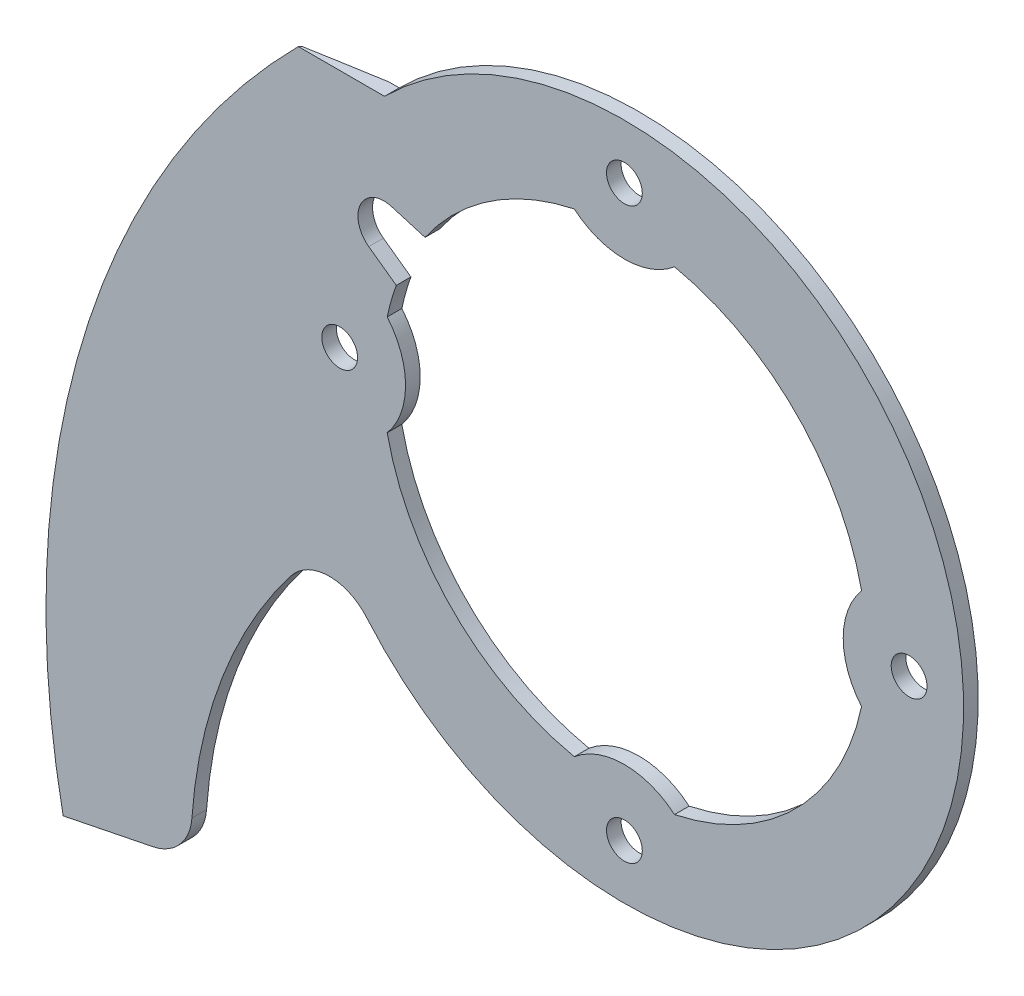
ISO-10303-21;
HEADER;
FILE_DESCRIPTION(('STEP AP214'),'2;1');
FILE_NAME('part.step','',(''),(''),'','','');
FILE_SCHEMA(('AUTOMOTIVE_DESIGN { 1 0 10303 214 1 1 1 1 }'));
ENDSEC;
DATA;
#1=APPLICATION_CONTEXT('core data for automotive mechanical design processes');
#2=APPLICATION_PROTOCOL_DEFINITION('international standard','automotive_design',2000,#1);
#3=PRODUCT_CONTEXT('',#1,'mechanical');
#4=PRODUCT('Part','Part','',(#3));
#5=PRODUCT_RELATED_PRODUCT_CATEGORY('part','',(#4));
#6=PRODUCT_DEFINITION_FORMATION('','',#4);
#7=PRODUCT_DEFINITION_CONTEXT('part definition',#1,'design');
#8=PRODUCT_DEFINITION('design','',#6,#7);
#9=PRODUCT_DEFINITION_SHAPE('','',#8);
#10=(LENGTH_UNIT() NAMED_UNIT(*) SI_UNIT(.MILLI.,.METRE.));
#11=(NAMED_UNIT(*) PLANE_ANGLE_UNIT() SI_UNIT($,.RADIAN.));
#12=(NAMED_UNIT(*) SI_UNIT($,.STERADIAN.) SOLID_ANGLE_UNIT());
#13=UNCERTAINTY_MEASURE_WITH_UNIT(LENGTH_MEASURE(1.E-05),#10,'distance_accuracy_value','');
#14=(GEOMETRIC_REPRESENTATION_CONTEXT(3) GLOBAL_UNCERTAINTY_ASSIGNED_CONTEXT((#13)) GLOBAL_UNIT_ASSIGNED_CONTEXT((#10,
#11,#12)) REPRESENTATION_CONTEXT('',''));
#15=CARTESIAN_POINT('',(0.,0.,0.));
#16=DIRECTION('',(0.,0.,1.));
#17=DIRECTION('',(1.,0.,0.));
#18=AXIS2_PLACEMENT_3D('',#15,#16,#17);
#19=CARTESIAN_POINT('',(0.,0.,0.));
#20=DIRECTION('',(0.,0.,1.));
#21=DIRECTION('',(1.,0.,0.));
#22=AXIS2_PLACEMENT_3D('',#19,#20,#21);
#23=PLANE('',#22);
#24=CARTESIAN_POINT('',(-1.83302876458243E-13,17.5,0.));
#25=DIRECTION('',(0.,0.,1.));
#26=DIRECTION('',(1.,0.,0.));
#27=AXIS2_PLACEMENT_3D('',#24,#25,#26);
#28=CIRCLE('',#27,1.1);
#29=CARTESIAN_POINT('',(1.09999999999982,17.5,0.));
#30=VERTEX_POINT('',#29);
#31=EDGE_CURVE('E182',#30,#30,#28,.T.);
#32=ORIENTED_EDGE('',*,*,#31,.T.);
#33=EDGE_LOOP('',(#32));
#34=FACE_BOUND('',#33,.T.);
#35=CARTESIAN_POINT('',(0.,0.,0.));
#36=DIRECTION('',(0.,0.,1.));
#37=DIRECTION('',(1.,0.,0.));
#38=AXIS2_PLACEMENT_3D('',#35,#36,#37);
#39=CIRCLE('',#38,14.9);
#40=CARTESIAN_POINT('',(3.08048237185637,-14.5780872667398,0.));
#41=VERTEX_POINT('',#40);
#42=CARTESIAN_POINT('',(14.5780872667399,-3.08048237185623,0.));
#43=VERTEX_POINT('',#42);
#44=EDGE_CURVE('E264',#41,#43,#39,.T.);
#45=ORIENTED_EDGE('',*,*,#44,.T.);
#46=CARTESIAN_POINT('',(18.22,1.27229653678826E-13,0.));
#47=DIRECTION('',(0.,0.,1.));
#48=DIRECTION('',(1.,0.,0.));
#49=AXIS2_PLACEMENT_3D('',#46,#47,#48);
#50=CIRCLE('',#49,4.77);
#51=CARTESIAN_POINT('',(14.5780872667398,3.08048237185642,0.));
#52=VERTEX_POINT('',#51);
#53=EDGE_CURVE('E262',#52,#43,#50,.T.);
#54=ORIENTED_EDGE('',*,*,#53,.F.);
#55=CARTESIAN_POINT('',(3.08048237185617,14.5780872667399,0.));
#56=VERTEX_POINT('',#55);
#57=EDGE_CURVE('E286',#52,#56,#39,.T.);
#58=ORIENTED_EDGE('',*,*,#57,.T.);
#59=CARTESIAN_POINT('',(-1.90844480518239E-13,18.22,0.));
#60=DIRECTION('',(0.,0.,1.));
#61=DIRECTION('',(1.,0.,0.));
#62=AXIS2_PLACEMENT_3D('',#59,#60,#61);
#63=CIRCLE('',#62,4.77);
#64=CARTESIAN_POINT('',(-3.08048237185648,14.5780872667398,0.));
#65=VERTEX_POINT('',#64);
#66=EDGE_CURVE('E283',#65,#56,#63,.T.);
#67=ORIENTED_EDGE('',*,*,#66,.F.);
#68=CARTESIAN_POINT('',(-12.2522810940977,8.4788919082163,0.));
#69=VERTEX_POINT('',#68);
#70=EDGE_CURVE('E282',#65,#69,#39,.T.);
#71=ORIENTED_EDGE('',*,*,#70,.T.);
#72=DIRECTION('',(-0.958968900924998,0.283511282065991,0.));
#73=VECTOR('',#72,1.);
#74=CARTESIAN_POINT('',(-12.2522810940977,8.4788919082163,0.));
#75=LINE('',#74,#73);
#76=CARTESIAN_POINT('',(-14.3261550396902,9.09201571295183,0.));
#77=VERTEX_POINT('',#76);
#78=EDGE_CURVE('E279',#69,#77,#75,.T.);
#79=ORIENTED_EDGE('',*,*,#78,.T.);
#80=CARTESIAN_POINT('',(-14.7797730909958,7.55766547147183,0.));
#81=DIRECTION('',(0.,0.,1.));
#82=DIRECTION('',(1.,0.,0.));
#83=AXIS2_PLACEMENT_3D('',#80,#81,#82);
#84=CIRCLE('',#83,1.6);
#85=CARTESIAN_POINT('',(-15.7137076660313,6.25852490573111,0.));
#86=VERTEX_POINT('',#85);
#87=EDGE_CURVE('E276',#77,#86,#84,.T.);
#88=ORIENTED_EDGE('',*,*,#87,.T.);
#89=DIRECTION('',(0.811962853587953,-0.583709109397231,0.));
#90=VECTOR('',#89,1.);
#91=CARTESIAN_POINT('',(-15.7137076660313,6.25852490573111,0.));
#92=LINE('',#91,#90);
#93=CARTESIAN_POINT('',(-14.0210912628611,5.04172587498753,0.));
#94=VERTEX_POINT('',#93);
#95=EDGE_CURVE('E273',#86,#94,#92,.T.);
#96=ORIENTED_EDGE('',*,*,#95,.T.);
#97=CARTESIAN_POINT('',(-14.5780872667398,3.08048237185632,0.));
#98=VERTEX_POINT('',#97);
#99=EDGE_CURVE('E272',#94,#98,#39,.T.);
#100=ORIENTED_EDGE('',*,*,#99,.T.);
#101=CARTESIAN_POINT('',(-18.22,0.,0.));
#102=DIRECTION('',(0.,0.,1.));
#103=DIRECTION('',(1.,0.,0.));
#104=AXIS2_PLACEMENT_3D('',#101,#102,#103);
#105=CIRCLE('',#104,4.77);
#106=CARTESIAN_POINT('',(-14.5780872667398,-3.08048237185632,0.));
#107=VERTEX_POINT('',#106);
#108=EDGE_CURVE('E269',#107,#98,#105,.T.);
#109=ORIENTED_EDGE('',*,*,#108,.F.);
#110=CARTESIAN_POINT('',(-3.08048237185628,-14.5780872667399,0.));
#111=VERTEX_POINT('',#110);
#112=EDGE_CURVE('E268',#107,#111,#39,.T.);
#113=ORIENTED_EDGE('',*,*,#112,.T.);
#114=CARTESIAN_POINT('',(0.,-18.22,0.));
#115=DIRECTION('',(0.,0.,1.));
#116=DIRECTION('',(1.,0.,0.));
#117=AXIS2_PLACEMENT_3D('',#114,#115,#116);
#118=CIRCLE('',#117,4.77);
#119=EDGE_CURVE('E265',#41,#111,#118,.T.);
#120=ORIENTED_EDGE('',*,*,#119,.F.);
#121=EDGE_LOOP('',(#45,#54,#58,#67,#71,#79,#88,#96,#100,#109,#113,#120));
#122=FACE_BOUND('',#121,.T.);
#123=CARTESIAN_POINT('',(0.,-17.5,0.));
#124=DIRECTION('',(0.,0.,1.));
#125=DIRECTION('',(1.,0.,0.));
#126=AXIS2_PLACEMENT_3D('',#123,#124,#125);
#127=CIRCLE('',#126,1.1);
#128=CARTESIAN_POINT('',(1.10000000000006,-17.5,0.));
#129=VERTEX_POINT('',#128);
#130=EDGE_CURVE('E348',#129,#129,#127,.T.);
#131=ORIENTED_EDGE('',*,*,#130,.T.);
#132=EDGE_LOOP('',(#131));
#133=FACE_BOUND('',#132,.T.);
#134=CARTESIAN_POINT('',(-17.5,0.,0.));
#135=DIRECTION('',(0.,0.,1.));
#136=DIRECTION('',(1.,0.,0.));
#137=AXIS2_PLACEMENT_3D('',#134,#135,#136);
#138=CIRCLE('',#137,1.1);
#139=CARTESIAN_POINT('',(-16.4,0.,0.));
#140=VERTEX_POINT('',#139);
#141=EDGE_CURVE('E199',#140,#140,#138,.T.);
#142=ORIENTED_EDGE('',*,*,#141,.T.);
#143=EDGE_LOOP('',(#142));
#144=FACE_BOUND('',#143,.T.);
#145=CARTESIAN_POINT('',(17.5,1.22201917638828E-13,0.));
#146=DIRECTION('',(0.,0.,1.));
#147=DIRECTION('',(1.,0.,0.));
#148=AXIS2_PLACEMENT_3D('',#145,#146,#147);
#149=CIRCLE('',#148,1.1);
#150=CARTESIAN_POINT('',(18.6,1.22201917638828E-13,0.));
#151=VERTEX_POINT('',#150);
#152=EDGE_CURVE('E342',#151,#151,#149,.T.);
#153=ORIENTED_EDGE('',*,*,#152,.T.);
#154=EDGE_LOOP('',(#153));
#155=FACE_BOUND('',#154,.T.);
#156=CARTESIAN_POINT('',(2.81403907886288,-31.6919290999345,0.));
#157=DIRECTION('',(0.,0.,-1.));
#158=DIRECTION('',(-1.,0.,0.));
#159=AXIS2_PLACEMENT_3D('',#156,#157,#158);
#160=CIRCLE('',#159,29.4703466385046);
#161=CARTESIAN_POINT('',(-26.5814833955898,-29.5932177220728,0.));
#162=VERTEX_POINT('',#161);
#163=CARTESIAN_POINT('',(-20.4997424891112,-13.6650347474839,0.));
#164=VERTEX_POINT('',#163);
#165=EDGE_CURVE('E196',#162,#164,#160,.T.);
#166=ORIENTED_EDGE('',*,*,#165,.F.);
#167=CARTESIAN_POINT('',(-29.5738665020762,-29.3795746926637,0.));
#168=DIRECTION('',(0.,0.,1.));
#169=DIRECTION('',(1.,0.,0.));
#170=AXIS2_PLACEMENT_3D('',#167,#168,#169);
#171=CIRCLE('',#170,3.);
#172=CARTESIAN_POINT('',(-28.9795506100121,-32.3201169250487,0.));
#173=VERTEX_POINT('',#172);
#174=EDGE_CURVE('E51',#162,#173,#171,.F.);
#175=ORIENTED_EDGE('',*,*,#174,.T.);
#176=DIRECTION('',(0.980180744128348,0.198105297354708,0.));
#177=VECTOR('',#176,1.);
#178=CARTESIAN_POINT('',(-34.4973270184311,-33.4353201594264,0.));
#179=LINE('',#178,#177);
#180=CARTESIAN_POINT('',(-31.3607486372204,-32.8013832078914,0.));
#181=VERTEX_POINT('',#180);
#182=EDGE_CURVE('E187',#181,#173,#179,.T.);
#183=ORIENTED_EDGE('',*,*,#182,.F.);
#184=CARTESIAN_POINT('',(17.7955101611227,-22.8663632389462,0.));
#185=DIRECTION('',(0.,0.,1.));
#186=DIRECTION('',(1.,0.,0.));
#187=AXIS2_PLACEMENT_3D('',#184,#185,#186);
#188=CIRCLE('',#187,50.1501984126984);
#189=CARTESIAN_POINT('',(-15.3792532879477,14.7431763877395,0.));
#190=VERTEX_POINT('',#189);
#191=EDGE_CURVE('E176',#190,#181,#188,.T.);
#192=ORIENTED_EDGE('',*,*,#191,.F.);
#193=DIRECTION('',(-1.,0.,0.));
#194=VECTOR('',#193,1.);
#195=CARTESIAN_POINT('',(-14.7431763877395,14.7431763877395,0.));
#196=LINE('',#195,#194);
#197=CARTESIAN_POINT('',(-14.7431763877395,14.7431763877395,0.));
#198=VERTEX_POINT('',#197);
#199=EDGE_CURVE('E186',#198,#190,#196,.T.);
#200=ORIENTED_EDGE('',*,*,#199,.F.);
#201=CARTESIAN_POINT('',(0.,0.,0.));
#202=DIRECTION('',(0.,0.,1.));
#203=DIRECTION('',(1.,0.,0.));
#204=AXIS2_PLACEMENT_3D('',#201,#202,#203);
#205=CIRCLE('',#204,20.85);
#206=CARTESIAN_POINT('',(-15.8464054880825,-13.5504218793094,0.));
#207=VERTEX_POINT('',#206);
#208=EDGE_CURVE('E204',#207,#198,#205,.T.);
#209=ORIENTED_EDGE('',*,*,#208,.F.);
#210=CARTESIAN_POINT('',(-18.1264638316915,-15.5001228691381,0.));
#211=DIRECTION('',(0.,0.,1.));
#212=DIRECTION('',(1.,0.,0.));
#213=AXIS2_PLACEMENT_3D('',#210,#211,#212);
#214=CIRCLE('',#213,3.);
#215=EDGE_CURVE('E407',#207,#164,#214,.T.);
#216=ORIENTED_EDGE('',*,*,#215,.T.);
#217=EDGE_LOOP('',(#166,#175,#183,#192,#200,#209,#216));
#218=FACE_BOUND('',#217,.T.);
#219=ADVANCED_FACE('F28',(#34,#122,#133,#144,#155,#218),#23,.F.);
#220=CARTESIAN_POINT('',(-14.7431763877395,14.7431763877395,0.9));
#221=DIRECTION('',(0.,-1.,0.));
#222=DIRECTION('',(1.,0.,0.));
#223=AXIS2_PLACEMENT_3D('',#220,#221,#222);
#224=PLANE('',#223);
#225=CARTESIAN_POINT('',(-28.745575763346,14.7431763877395,2.4218749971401));
#226=CARTESIAN_POINT('',(-27.9623567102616,14.7431763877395,2.26958447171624));
#227=CARTESIAN_POINT('',(-27.1788547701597,14.7431763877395,2.11874863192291));
#228=CARTESIAN_POINT('',(-25.6112343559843,14.7431763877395,1.82029784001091));
#229=CARTESIAN_POINT('',(-24.8271158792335,14.7431763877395,1.67268290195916));
#230=CARTESIAN_POINT('',(-22.4739706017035,14.7431763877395,1.23517603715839));
#231=CARTESIAN_POINT('',(-20.9039534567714,14.7431763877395,0.950582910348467));
#232=CARTESIAN_POINT('',(-17.7608209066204,14.7431763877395,0.398540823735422));
#233=CARTESIAN_POINT('',(-16.1877053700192,14.7431763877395,0.131092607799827));
#234=CARTESIAN_POINT('',(-13.8253794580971,14.7431763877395,-0.254423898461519));
#235=CARTESIAN_POINT('',(-13.0374459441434,14.7431763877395,-0.380327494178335));
#236=CARTESIAN_POINT('',(-11.4606698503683,14.7431763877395,-0.626361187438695));
#237=CARTESIAN_POINT('',(-10.6718272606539,14.7431763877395,-0.74649122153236));
#238=CARTESIAN_POINT('',(-9.88251001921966,14.7431763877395,-0.863458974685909));
#239=B_SPLINE_CURVE_WITH_KNOTS('',3,(#225,#226,#227,#228,#229,#230,#231,#232,#233,#234,#235,
#236,#237,#238),.UNSPECIFIED.,.F.,.F.,(4,2,2,2,2,2,4),(0.,2.39366052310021,4.78733149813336,
9.57406061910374,14.3609972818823,16.7547655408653,19.1485601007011),.UNSPECIFIED.);
#240=CARTESIAN_POINT('',(-19.944627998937,14.7431763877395,0.782537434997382));
#241=VERTEX_POINT('',#240);
#242=EDGE_CURVE('E172',#241,#190,#239,.T.);
#243=ORIENTED_EDGE('',*,*,#242,.F.);
#244=CARTESIAN_POINT('',(-19.944627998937,14.7431763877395,0.782537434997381));
#245=CARTESIAN_POINT('',(-19.9610589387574,14.7431763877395,0.801935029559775));
#246=CARTESIAN_POINT('',(-19.9774867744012,14.7431763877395,0.821335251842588));
#247=CARTESIAN_POINT('',(-20.0103362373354,14.7431763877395,0.860140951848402));
#248=CARTESIAN_POINT('',(-20.0267578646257,14.7431763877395,0.879546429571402));
#249=CARTESIAN_POINT('',(-20.0431763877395,14.7431763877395,0.898954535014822));
#250=B_SPLINE_CURVE_WITH_KNOTS('',3,(#244,#245,#246,#247,#248,#249),.UNSPECIFIED.,.F.,.F.,(4,2,
4),(0.,0.0762638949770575,0.152527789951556),.UNSPECIFIED.);
#251=CARTESIAN_POINT('',(-20.0431763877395,14.7431763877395,0.898954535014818));
#252=VERTEX_POINT('',#251);
#253=EDGE_CURVE('E231',#241,#252,#250,.T.);
#254=ORIENTED_EDGE('',*,*,#253,.T.);
#255=DIRECTION('',(0.,0.,-1.));
#256=VECTOR('',#255,1.);
#257=CARTESIAN_POINT('',(-20.0431763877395,14.7431763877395,0.9));
#258=LINE('',#257,#256);
#259=CARTESIAN_POINT('',(-20.0431763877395,14.7431763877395,0.9));
#260=VERTEX_POINT('',#259);
#261=EDGE_CURVE('E221',#260,#252,#258,.T.);
#262=ORIENTED_EDGE('',*,*,#261,.F.);
#263=DIRECTION('',(-1.,0.,0.));
#264=VECTOR('',#263,1.);
#265=CARTESIAN_POINT('',(-14.7431763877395,14.7431763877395,0.9));
#266=LINE('',#265,#264);
#267=CARTESIAN_POINT('',(-14.7431763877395,14.7431763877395,0.9));
#268=VERTEX_POINT('',#267);
#269=EDGE_CURVE('E207',#268,#260,#266,.T.);
#270=ORIENTED_EDGE('',*,*,#269,.F.);
#271=DIRECTION('',(0.,0.,-1.));
#272=VECTOR('',#271,1.);
#273=CARTESIAN_POINT('',(-14.7431763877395,14.7431763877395,0.9));
#274=LINE('',#273,#272);
#275=EDGE_CURVE('E193',#268,#198,#274,.T.);
#276=ORIENTED_EDGE('',*,*,#275,.T.);
#277=ORIENTED_EDGE('',*,*,#199,.T.);
#278=EDGE_LOOP('',(#243,#254,#262,#270,#276,#277));
#279=FACE_BOUND('',#278,.T.);
#280=ADVANCED_FACE('F30',(#279),#224,.F.);
#281=CARTESIAN_POINT('',(17.7955101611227,-22.8663632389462,0.9));
#282=DIRECTION('',(0.,0.,-1.));
#283=DIRECTION('',(-1.,0.,0.));
#284=AXIS2_PLACEMENT_3D('',#281,#282,#283);
#285=CYLINDRICAL_SURFACE('',#284,53.3501984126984);
#286=ORIENTED_EDGE('',*,*,#261,.T.);
#287=CARTESIAN_POINT('',(17.7955101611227,-22.8663632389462,0.898954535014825));
#288=DIRECTION('',(0.,0.,-1.));
#289=DIRECTION('',(-1.,0.,0.));
#290=AXIS2_PLACEMENT_3D('',#287,#288,#289);
#291=CIRCLE('',#290,53.3501984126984);
#292=CARTESIAN_POINT('',(-34.4973270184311,-33.4353201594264,0.898954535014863));
#293=VERTEX_POINT('',#292);
#294=EDGE_CURVE('E225',#252,#293,#291,.F.);
#295=ORIENTED_EDGE('',*,*,#294,.T.);
#296=DIRECTION('',(0.,0.,-1.));
#297=VECTOR('',#296,1.);
#298=CARTESIAN_POINT('',(-34.4973270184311,-33.4353201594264,0.9));
#299=LINE('',#298,#297);
#300=CARTESIAN_POINT('',(-34.4973270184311,-33.4353201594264,0.9));
#301=VERTEX_POINT('',#300);
#302=EDGE_CURVE('E217',#301,#293,#299,.T.);
#303=ORIENTED_EDGE('',*,*,#302,.F.);
#304=CARTESIAN_POINT('',(17.7955101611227,-22.8663632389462,0.9));
#305=DIRECTION('',(0.,0.,1.));
#306=DIRECTION('',(1.,0.,0.));
#307=AXIS2_PLACEMENT_3D('',#304,#305,#306);
#308=CIRCLE('',#307,53.3501984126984);
#309=EDGE_CURVE('E210',#260,#301,#308,.T.);
#310=ORIENTED_EDGE('',*,*,#309,.F.);
#311=EDGE_LOOP('',(#286,#295,#303,#310));
#312=FACE_BOUND('',#311,.T.);
#313=ADVANCED_FACE('F380',(#312),#285,.T.);
#314=CARTESIAN_POINT('',(-34.4973270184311,-33.4353201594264,0.9));
#315=DIRECTION('',(-0.198105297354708,0.980180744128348,0.));
#316=DIRECTION('',(-0.980180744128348,-0.198105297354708,0.));
#317=AXIS2_PLACEMENT_3D('',#314,#315,#316);
#318=PLANE('',#317);
#319=ORIENTED_EDGE('',*,*,#182,.T.);
#320=DIRECTION('',(0.,0.,-1.));
#321=VECTOR('',#320,1.);
#322=CARTESIAN_POINT('',(-28.9795506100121,-32.3201169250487,0.9));
#323=LINE('',#322,#321);
#324=CARTESIAN_POINT('',(-28.9795506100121,-32.3201169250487,0.9));
#325=VERTEX_POINT('',#324);
#326=EDGE_CURVE('E37',#173,#325,#323,.F.);
#327=ORIENTED_EDGE('',*,*,#326,.T.);
#328=DIRECTION('',(0.980180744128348,0.198105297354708,0.));
#329=VECTOR('',#328,1.);
#330=CARTESIAN_POINT('',(-34.4973270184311,-33.4353201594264,0.9));
#331=LINE('',#330,#329);
#332=EDGE_CURVE('E213',#301,#325,#331,.T.);
#333=ORIENTED_EDGE('',*,*,#332,.F.);
#334=ORIENTED_EDGE('',*,*,#302,.T.);
#335=DIRECTION('',(-0.504298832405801,-0.1019243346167,0.857492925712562));
#336=VECTOR('',#335,1.);
#337=CARTESIAN_POINT('',(17.7955101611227,-22.8663632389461,-88.0180428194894));
#338=LINE('',#337,#336);
#339=CARTESIAN_POINT('',(-34.4288611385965,-33.4214824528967,0.782537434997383));
#340=VERTEX_POINT('',#339);
#341=EDGE_CURVE('E228',#293,#340,#338,.F.);
#342=ORIENTED_EDGE('',*,*,#341,.T.);
#343=DIRECTION('',(0.950914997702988,0.192190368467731,-0.242535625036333));
#344=VECTOR('',#343,1.);
#345=CARTESIAN_POINT('',(-34.4973270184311,-33.4353201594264,0.8));
#346=LINE('',#345,#344);
#347=EDGE_CURVE('E188',#340,#181,#346,.T.);
#348=ORIENTED_EDGE('',*,*,#347,.T.);
#349=EDGE_LOOP('',(#319,#327,#333,#334,#342,#348));
#350=FACE_BOUND('',#349,.T.);
#351=ADVANCED_FACE('F385',(#350),#318,.F.);
#352=CARTESIAN_POINT('',(0.,0.,0.9));
#353=DIRECTION('',(0.,0.,1.));
#354=DIRECTION('',(1.,0.,0.));
#355=AXIS2_PLACEMENT_3D('',#352,#353,#354);
#356=PLANE('',#355);
#357=CARTESIAN_POINT('',(17.5,1.22201917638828E-13,0.9));
#358=DIRECTION('',(0.,0.,1.));
#359=DIRECTION('',(1.,0.,0.));
#360=AXIS2_PLACEMENT_3D('',#357,#358,#359);
#361=CIRCLE('',#360,1.1);
#362=CARTESIAN_POINT('',(18.6,1.22201917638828E-13,0.9));
#363=VERTEX_POINT('',#362);
#364=EDGE_CURVE('E345',#363,#363,#361,.T.);
#365=ORIENTED_EDGE('',*,*,#364,.F.);
#366=EDGE_LOOP('',(#365));
#367=FACE_BOUND('',#366,.T.);
#368=CARTESIAN_POINT('',(-17.5,0.,0.9));
#369=DIRECTION('',(0.,0.,1.));
#370=DIRECTION('',(1.,0.,0.));
#371=AXIS2_PLACEMENT_3D('',#368,#369,#370);
#372=CIRCLE('',#371,1.1);
#373=CARTESIAN_POINT('',(-16.4,0.,0.9));
#374=VERTEX_POINT('',#373);
#375=EDGE_CURVE('E194',#374,#374,#372,.T.);
#376=ORIENTED_EDGE('',*,*,#375,.F.);
#377=EDGE_LOOP('',(#376));
#378=FACE_BOUND('',#377,.T.);
#379=ORIENTED_EDGE('',*,*,#332,.T.);
#380=CARTESIAN_POINT('',(-29.5738665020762,-29.3795746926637,0.9));
#381=DIRECTION('',(0.,0.,1.));
#382=DIRECTION('',(1.,0.,0.));
#383=AXIS2_PLACEMENT_3D('',#380,#381,#382);
#384=CIRCLE('',#383,3.);
#385=CARTESIAN_POINT('',(-26.5814833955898,-29.5932177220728,0.9));
#386=VERTEX_POINT('',#385);
#387=EDGE_CURVE('E11',#325,#386,#384,.T.);
#388=ORIENTED_EDGE('',*,*,#387,.T.);
#389=CARTESIAN_POINT('',(2.81403907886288,-31.6919290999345,0.9));
#390=DIRECTION('',(0.,0.,-1.));
#391=DIRECTION('',(-1.,0.,0.));
#392=AXIS2_PLACEMENT_3D('',#389,#390,#391);
#393=CIRCLE('',#392,29.4703466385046);
#394=CARTESIAN_POINT('',(-20.4997424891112,-13.6650347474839,0.9));
#395=VERTEX_POINT('',#394);
#396=EDGE_CURVE('E215',#386,#395,#393,.T.);
#397=ORIENTED_EDGE('',*,*,#396,.T.);
#398=CARTESIAN_POINT('',(-18.1264638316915,-15.5001228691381,0.9));
#399=DIRECTION('',(0.,0.,1.));
#400=DIRECTION('',(1.,0.,0.));
#401=AXIS2_PLACEMENT_3D('',#398,#399,#400);
#402=CIRCLE('',#401,3.);
#403=CARTESIAN_POINT('',(-15.8464054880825,-13.5504218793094,0.9));
#404=VERTEX_POINT('',#403);
#405=EDGE_CURVE('E403',#395,#404,#402,.F.);
#406=ORIENTED_EDGE('',*,*,#405,.T.);
#407=CARTESIAN_POINT('',(0.,0.,0.9));
#408=DIRECTION('',(0.,0.,1.));
#409=DIRECTION('',(1.,0.,0.));
#410=AXIS2_PLACEMENT_3D('',#407,#408,#409);
#411=CIRCLE('',#410,20.85);
#412=EDGE_CURVE('E206',#404,#268,#411,.T.);
#413=ORIENTED_EDGE('',*,*,#412,.T.);
#414=ORIENTED_EDGE('',*,*,#269,.T.);
#415=ORIENTED_EDGE('',*,*,#309,.T.);
#416=EDGE_LOOP('',(#379,#388,#397,#406,#413,#414,#415));
#417=FACE_BOUND('',#416,.T.);
#418=CARTESIAN_POINT('',(0.,-17.5,0.9));
#419=DIRECTION('',(0.,0.,1.));
#420=DIRECTION('',(1.,0.,0.));
#421=AXIS2_PLACEMENT_3D('',#418,#419,#420);
#422=CIRCLE('',#421,1.1);
#423=CARTESIAN_POINT('',(1.10000000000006,-17.5,0.9));
#424=VERTEX_POINT('',#423);
#425=EDGE_CURVE('E351',#424,#424,#422,.T.);
#426=ORIENTED_EDGE('',*,*,#425,.F.);
#427=EDGE_LOOP('',(#426));
#428=FACE_BOUND('',#427,.T.);
#429=CARTESIAN_POINT('',(18.22,1.27229653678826E-13,0.9));
#430=DIRECTION('',(0.,0.,1.));
#431=DIRECTION('',(1.,0.,0.));
#432=AXIS2_PLACEMENT_3D('',#429,#430,#431);
#433=CIRCLE('',#432,4.77);
#434=CARTESIAN_POINT('',(14.5780872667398,3.08048237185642,0.9));
#435=VERTEX_POINT('',#434);
#436=CARTESIAN_POINT('',(14.5780872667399,-3.08048237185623,0.9));
#437=VERTEX_POINT('',#436);
#438=EDGE_CURVE('E289',#435,#437,#433,.T.);
#439=ORIENTED_EDGE('',*,*,#438,.T.);
#440=CARTESIAN_POINT('',(0.,0.,0.9));
#441=DIRECTION('',(0.,0.,1.));
#442=DIRECTION('',(1.,0.,0.));
#443=AXIS2_PLACEMENT_3D('',#440,#441,#442);
#444=CIRCLE('',#443,14.9);
#445=CARTESIAN_POINT('',(3.08048237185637,-14.5780872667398,0.9));
#446=VERTEX_POINT('',#445);
#447=EDGE_CURVE('E292',#446,#437,#444,.T.);
#448=ORIENTED_EDGE('',*,*,#447,.F.);
#449=CARTESIAN_POINT('',(0.,-18.22,0.9));
#450=DIRECTION('',(0.,0.,1.));
#451=DIRECTION('',(1.,0.,0.));
#452=AXIS2_PLACEMENT_3D('',#449,#450,#451);
#453=CIRCLE('',#452,4.77);
#454=CARTESIAN_POINT('',(-3.08048237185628,-14.5780872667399,0.9));
#455=VERTEX_POINT('',#454);
#456=EDGE_CURVE('E293',#446,#455,#453,.T.);
#457=ORIENTED_EDGE('',*,*,#456,.T.);
#458=CARTESIAN_POINT('',(-14.5780872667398,-3.08048237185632,0.9));
#459=VERTEX_POINT('',#458);
#460=EDGE_CURVE('E296',#459,#455,#444,.T.);
#461=ORIENTED_EDGE('',*,*,#460,.F.);
#462=CARTESIAN_POINT('',(-18.22,0.,0.9));
#463=DIRECTION('',(0.,0.,1.));
#464=DIRECTION('',(1.,0.,0.));
#465=AXIS2_PLACEMENT_3D('',#462,#463,#464);
#466=CIRCLE('',#465,4.77);
#467=CARTESIAN_POINT('',(-14.5780872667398,3.08048237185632,0.9));
#468=VERTEX_POINT('',#467);
#469=EDGE_CURVE('E297',#459,#468,#466,.T.);
#470=ORIENTED_EDGE('',*,*,#469,.T.);
#471=CARTESIAN_POINT('',(-14.0210912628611,5.04172587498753,0.9));
#472=VERTEX_POINT('',#471);
#473=EDGE_CURVE('E300',#472,#468,#444,.T.);
#474=ORIENTED_EDGE('',*,*,#473,.F.);
#475=DIRECTION('',(0.811962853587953,-0.583709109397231,0.));
#476=VECTOR('',#475,1.);
#477=CARTESIAN_POINT('',(-15.7137076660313,6.25852490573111,0.9));
#478=LINE('',#477,#476);
#479=CARTESIAN_POINT('',(-15.7137076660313,6.25852490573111,0.9));
#480=VERTEX_POINT('',#479);
#481=EDGE_CURVE('E301',#480,#472,#478,.T.);
#482=ORIENTED_EDGE('',*,*,#481,.F.);
#483=CARTESIAN_POINT('',(-14.7797730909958,7.55766547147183,0.9));
#484=DIRECTION('',(0.,0.,1.));
#485=DIRECTION('',(1.,0.,0.));
#486=AXIS2_PLACEMENT_3D('',#483,#484,#485);
#487=CIRCLE('',#486,1.6);
#488=CARTESIAN_POINT('',(-14.3261550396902,9.09201571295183,0.9));
#489=VERTEX_POINT('',#488);
#490=EDGE_CURVE('E304',#489,#480,#487,.T.);
#491=ORIENTED_EDGE('',*,*,#490,.F.);
#492=DIRECTION('',(-0.958968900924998,0.283511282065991,0.));
#493=VECTOR('',#492,1.);
#494=CARTESIAN_POINT('',(-12.2522810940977,8.4788919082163,0.9));
#495=LINE('',#494,#493);
#496=CARTESIAN_POINT('',(-12.2522810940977,8.4788919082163,0.9));
#497=VERTEX_POINT('',#496);
#498=EDGE_CURVE('E307',#497,#489,#495,.T.);
#499=ORIENTED_EDGE('',*,*,#498,.F.);
#500=CARTESIAN_POINT('',(-3.08048237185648,14.5780872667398,0.9));
#501=VERTEX_POINT('',#500);
#502=EDGE_CURVE('E310',#501,#497,#444,.T.);
#503=ORIENTED_EDGE('',*,*,#502,.F.);
#504=CARTESIAN_POINT('',(-1.90844480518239E-13,18.22,0.9));
#505=DIRECTION('',(0.,0.,1.));
#506=DIRECTION('',(1.,0.,0.));
#507=AXIS2_PLACEMENT_3D('',#504,#505,#506);
#508=CIRCLE('',#507,4.77);
#509=CARTESIAN_POINT('',(3.08048237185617,14.5780872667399,0.9));
#510=VERTEX_POINT('',#509);
#511=EDGE_CURVE('E311',#501,#510,#508,.T.);
#512=ORIENTED_EDGE('',*,*,#511,.T.);
#513=EDGE_CURVE('E314',#435,#510,#444,.T.);
#514=ORIENTED_EDGE('',*,*,#513,.F.);
#515=EDGE_LOOP('',(#439,#448,#457,#461,#470,#474,#482,#491,#499,#503,#512,#514));
#516=FACE_BOUND('',#515,.T.);
#517=CARTESIAN_POINT('',(-1.83302876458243E-13,17.5,0.9));
#518=DIRECTION('',(0.,0.,1.));
#519=DIRECTION('',(1.,0.,0.));
#520=AXIS2_PLACEMENT_3D('',#517,#518,#519);
#521=CIRCLE('',#520,1.1);
#522=CARTESIAN_POINT('',(1.09999999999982,17.5,0.9));
#523=VERTEX_POINT('',#522);
#524=EDGE_CURVE('E259',#523,#523,#521,.T.);
#525=ORIENTED_EDGE('',*,*,#524,.F.);
#526=EDGE_LOOP('',(#525));
#527=FACE_BOUND('',#526,.T.);
#528=ADVANCED_FACE('F383',(#367,#378,#417,#428,#516,#527),#356,.T.);
#529=CARTESIAN_POINT('',(2.81403907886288,-31.6919290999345,0.9));
#530=DIRECTION('',(0.,0.,-1.));
#531=DIRECTION('',(-1.,0.,0.));
#532=AXIS2_PLACEMENT_3D('',#529,#530,#531);
#533=CYLINDRICAL_SURFACE('',#532,29.4703466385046);
#534=ORIENTED_EDGE('',*,*,#396,.F.);
#535=DIRECTION('',(0.,0.,-1.));
#536=VECTOR('',#535,1.);
#537=CARTESIAN_POINT('',(-26.5814833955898,-29.5932177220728,0.9));
#538=LINE('',#537,#536);
#539=EDGE_CURVE('E416',#386,#162,#538,.T.);
#540=ORIENTED_EDGE('',*,*,#539,.T.);
#541=ORIENTED_EDGE('',*,*,#165,.T.);
#542=DIRECTION('',(0.,0.,-1.));
#543=VECTOR('',#542,1.);
#544=CARTESIAN_POINT('',(-20.4997424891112,-13.6650347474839,0.9));
#545=LINE('',#544,#543);
#546=EDGE_CURVE('E410',#164,#395,#545,.F.);
#547=ORIENTED_EDGE('',*,*,#546,.T.);
#548=EDGE_LOOP('',(#534,#540,#541,#547));
#549=FACE_BOUND('',#548,.T.);
#550=ADVANCED_FACE('F371',(#549),#533,.F.);
#551=CARTESIAN_POINT('',(0.,0.,0.9));
#552=DIRECTION('',(0.,0.,-1.));
#553=DIRECTION('',(-1.,0.,0.));
#554=AXIS2_PLACEMENT_3D('',#551,#552,#553);
#555=CYLINDRICAL_SURFACE('',#554,20.85);
#556=ORIENTED_EDGE('',*,*,#412,.F.);
#557=DIRECTION('',(0.,0.,-1.));
#558=VECTOR('',#557,1.);
#559=CARTESIAN_POINT('',(-15.8464054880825,-13.5504218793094,0.9));
#560=LINE('',#559,#558);
#561=EDGE_CURVE('E237',#404,#207,#560,.T.);
#562=ORIENTED_EDGE('',*,*,#561,.T.);
#563=ORIENTED_EDGE('',*,*,#208,.T.);
#564=ORIENTED_EDGE('',*,*,#275,.F.);
#565=EDGE_LOOP('',(#556,#562,#563,#564));
#566=FACE_BOUND('',#565,.T.);
#567=ADVANCED_FACE('F361',(#566),#555,.T.);
#568=CARTESIAN_POINT('',(-17.5,0.,0.9));
#569=DIRECTION('',(0.,0.,-1.));
#570=DIRECTION('',(-1.,0.,0.));
#571=AXIS2_PLACEMENT_3D('',#568,#569,#570);
#572=CYLINDRICAL_SURFACE('',#571,1.1);
#573=ORIENTED_EDGE('',*,*,#375,.T.);
#574=EDGE_LOOP('',(#573));
#575=FACE_BOUND('',#574,.T.);
#576=ORIENTED_EDGE('',*,*,#141,.F.);
#577=EDGE_LOOP('',(#576));
#578=FACE_BOUND('',#577,.T.);
#579=ADVANCED_FACE('F358',(#575,#578),#572,.F.);
#580=CARTESIAN_POINT('',(0.,-17.5,0.9));
#581=DIRECTION('',(0.,0.,-1.));
#582=DIRECTION('',(-1.,0.,0.));
#583=AXIS2_PLACEMENT_3D('',#580,#581,#582);
#584=CYLINDRICAL_SURFACE('',#583,1.1);
#585=ORIENTED_EDGE('',*,*,#425,.T.);
#586=EDGE_LOOP('',(#585));
#587=FACE_BOUND('',#586,.T.);
#588=ORIENTED_EDGE('',*,*,#130,.F.);
#589=EDGE_LOOP('',(#588));
#590=FACE_BOUND('',#589,.T.);
#591=ADVANCED_FACE('F360',(#587,#590),#584,.F.);
#592=CARTESIAN_POINT('',(17.5,1.22201917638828E-13,0.9));
#593=DIRECTION('',(0.,0.,-1.));
#594=DIRECTION('',(-1.,0.,0.));
#595=AXIS2_PLACEMENT_3D('',#592,#593,#594);
#596=CYLINDRICAL_SURFACE('',#595,1.1);
#597=ORIENTED_EDGE('',*,*,#364,.T.);
#598=EDGE_LOOP('',(#597));
#599=FACE_BOUND('',#598,.T.);
#600=ORIENTED_EDGE('',*,*,#152,.F.);
#601=EDGE_LOOP('',(#600));
#602=FACE_BOUND('',#601,.T.);
#603=ADVANCED_FACE('F368',(#599,#602),#596,.F.);
#604=CARTESIAN_POINT('',(18.22,1.27229653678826E-13,0.9));
#605=DIRECTION('',(0.,0.,-1.));
#606=DIRECTION('',(-1.,0.,0.));
#607=AXIS2_PLACEMENT_3D('',#604,#605,#606);
#608=CYLINDRICAL_SURFACE('',#607,4.77);
#609=DIRECTION('',(0.,0.,-1.));
#610=VECTOR('',#609,1.);
#611=CARTESIAN_POINT('',(14.5780872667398,3.08048237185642,0.9));
#612=LINE('',#611,#610);
#613=EDGE_CURVE('E340',#435,#52,#612,.T.);
#614=ORIENTED_EDGE('',*,*,#613,.T.);
#615=ORIENTED_EDGE('',*,*,#53,.T.);
#616=DIRECTION('',(0.,0.,-1.));
#617=VECTOR('',#616,1.);
#618=CARTESIAN_POINT('',(14.5780872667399,-3.08048237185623,0.9));
#619=LINE('',#618,#617);
#620=EDGE_CURVE('E317',#437,#43,#619,.T.);
#621=ORIENTED_EDGE('',*,*,#620,.F.);
#622=ORIENTED_EDGE('',*,*,#438,.F.);
#623=EDGE_LOOP('',(#614,#615,#621,#622));
#624=FACE_BOUND('',#623,.T.);
#625=ADVANCED_FACE('F526',(#624),#608,.T.);
#626=CARTESIAN_POINT('',(0.,0.,0.9));
#627=DIRECTION('',(0.,0.,-1.));
#628=DIRECTION('',(-1.,0.,0.));
#629=AXIS2_PLACEMENT_3D('',#626,#627,#628);
#630=CYLINDRICAL_SURFACE('',#629,14.9);
#631=DIRECTION('',(0.,0.,-1.));
#632=VECTOR('',#631,1.);
#633=CARTESIAN_POINT('',(3.08048237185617,14.5780872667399,0.9));
#634=LINE('',#633,#632);
#635=EDGE_CURVE('E338',#510,#56,#634,.T.);
#636=ORIENTED_EDGE('',*,*,#635,.T.);
#637=ORIENTED_EDGE('',*,*,#57,.F.);
#638=ORIENTED_EDGE('',*,*,#613,.F.);
#639=ORIENTED_EDGE('',*,*,#513,.T.);
#640=EDGE_LOOP('',(#636,#637,#638,#639));
#641=FACE_BOUND('',#640,.T.);
#642=ADVANCED_FACE('F452',(#641),#630,.F.);
#643=CARTESIAN_POINT('',(-1.90844480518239E-13,18.22,0.9));
#644=DIRECTION('',(0.,0.,-1.));
#645=DIRECTION('',(-1.,0.,0.));
#646=AXIS2_PLACEMENT_3D('',#643,#644,#645);
#647=CYLINDRICAL_SURFACE('',#646,4.77);
#648=DIRECTION('',(0.,0.,-1.));
#649=VECTOR('',#648,1.);
#650=CARTESIAN_POINT('',(-3.08048237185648,14.5780872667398,0.9));
#651=LINE('',#650,#649);
#652=EDGE_CURVE('E336',#501,#65,#651,.T.);
#653=ORIENTED_EDGE('',*,*,#652,.T.);
#654=ORIENTED_EDGE('',*,*,#66,.T.);
#655=ORIENTED_EDGE('',*,*,#635,.F.);
#656=ORIENTED_EDGE('',*,*,#511,.F.);
#657=EDGE_LOOP('',(#653,#654,#655,#656));
#658=FACE_BOUND('',#657,.T.);
#659=ADVANCED_FACE('F512',(#658),#647,.T.);
#660=DIRECTION('',(0.,0.,-1.));
#661=VECTOR('',#660,1.);
#662=CARTESIAN_POINT('',(-12.2522810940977,8.4788919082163,0.9));
#663=LINE('',#662,#661);
#664=EDGE_CURVE('E334',#497,#69,#663,.T.);
#665=ORIENTED_EDGE('',*,*,#664,.T.);
#666=ORIENTED_EDGE('',*,*,#70,.F.);
#667=ORIENTED_EDGE('',*,*,#652,.F.);
#668=ORIENTED_EDGE('',*,*,#502,.T.);
#669=EDGE_LOOP('',(#665,#666,#667,#668));
#670=FACE_BOUND('',#669,.T.);
#671=ADVANCED_FACE('F483',(#670),#630,.F.);
#672=CARTESIAN_POINT('',(-12.2522810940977,8.4788919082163,0.9));
#673=DIRECTION('',(-0.283511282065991,-0.958968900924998,0.));
#674=DIRECTION('',(0.958968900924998,-0.283511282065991,0.));
#675=AXIS2_PLACEMENT_3D('',#672,#673,#674);
#676=PLANE('',#675);
#677=DIRECTION('',(0.,0.,-1.));
#678=VECTOR('',#677,1.);
#679=CARTESIAN_POINT('',(-14.3261550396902,9.09201571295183,0.9));
#680=LINE('',#679,#678);
#681=EDGE_CURVE('E332',#489,#77,#680,.T.);
#682=ORIENTED_EDGE('',*,*,#681,.T.);
#683=ORIENTED_EDGE('',*,*,#78,.F.);
#684=ORIENTED_EDGE('',*,*,#664,.F.);
#685=ORIENTED_EDGE('',*,*,#498,.T.);
#686=EDGE_LOOP('',(#682,#683,#684,#685));
#687=FACE_BOUND('',#686,.T.);
#688=ADVANCED_FACE('F497',(#687),#676,.T.);
#689=CARTESIAN_POINT('',(-14.7797730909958,7.55766547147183,0.9));
#690=DIRECTION('',(0.,0.,-1.));
#691=DIRECTION('',(-1.,0.,0.));
#692=AXIS2_PLACEMENT_3D('',#689,#690,#691);
#693=CYLINDRICAL_SURFACE('',#692,1.6);
#694=DIRECTION('',(0.,0.,-1.));
#695=VECTOR('',#694,1.);
#696=CARTESIAN_POINT('',(-15.7137076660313,6.25852490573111,0.9));
#697=LINE('',#696,#695);
#698=EDGE_CURVE('E330',#480,#86,#697,.T.);
#699=ORIENTED_EDGE('',*,*,#698,.T.);
#700=ORIENTED_EDGE('',*,*,#87,.F.);
#701=ORIENTED_EDGE('',*,*,#681,.F.);
#702=ORIENTED_EDGE('',*,*,#490,.T.);
#703=EDGE_LOOP('',(#699,#700,#701,#702));
#704=FACE_BOUND('',#703,.T.);
#705=ADVANCED_FACE('F489',(#704),#693,.F.);
#706=CARTESIAN_POINT('',(-15.7137076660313,6.25852490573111,0.9));
#707=DIRECTION('',(0.583709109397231,0.811962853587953,0.));
#708=DIRECTION('',(-0.811962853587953,0.583709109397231,0.));
#709=AXIS2_PLACEMENT_3D('',#706,#707,#708);
#710=PLANE('',#709);
#711=DIRECTION('',(0.,0.,-1.));
#712=VECTOR('',#711,1.);
#713=CARTESIAN_POINT('',(-14.0210912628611,5.04172587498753,0.9));
#714=LINE('',#713,#712);
#715=EDGE_CURVE('E328',#472,#94,#714,.T.);
#716=ORIENTED_EDGE('',*,*,#715,.T.);
#717=ORIENTED_EDGE('',*,*,#95,.F.);
#718=ORIENTED_EDGE('',*,*,#698,.F.);
#719=ORIENTED_EDGE('',*,*,#481,.T.);
#720=EDGE_LOOP('',(#716,#717,#718,#719));
#721=FACE_BOUND('',#720,.T.);
#722=ADVANCED_FACE('F481',(#721),#710,.T.);
#723=DIRECTION('',(0.,0.,-1.));
#724=VECTOR('',#723,1.);
#725=CARTESIAN_POINT('',(-14.5780872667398,3.08048237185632,0.9));
#726=LINE('',#725,#724);
#727=EDGE_CURVE('E326',#468,#98,#726,.T.);
#728=ORIENTED_EDGE('',*,*,#727,.T.);
#729=ORIENTED_EDGE('',*,*,#99,.F.);
#730=ORIENTED_EDGE('',*,*,#715,.F.);
#731=ORIENTED_EDGE('',*,*,#473,.T.);
#732=EDGE_LOOP('',(#728,#729,#730,#731));
#733=FACE_BOUND('',#732,.T.);
#734=ADVANCED_FACE('F468',(#733),#630,.F.);
#735=CARTESIAN_POINT('',(-18.22,0.,0.9));
#736=DIRECTION('',(0.,0.,-1.));
#737=DIRECTION('',(-1.,0.,0.));
#738=AXIS2_PLACEMENT_3D('',#735,#736,#737);
#739=CYLINDRICAL_SURFACE('',#738,4.77);
#740=DIRECTION('',(0.,0.,-1.));
#741=VECTOR('',#740,1.);
#742=CARTESIAN_POINT('',(-14.5780872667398,-3.08048237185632,0.9));
#743=LINE('',#742,#741);
#744=EDGE_CURVE('E324',#459,#107,#743,.T.);
#745=ORIENTED_EDGE('',*,*,#744,.T.);
#746=ORIENTED_EDGE('',*,*,#108,.T.);
#747=ORIENTED_EDGE('',*,*,#727,.F.);
#748=ORIENTED_EDGE('',*,*,#469,.F.);
#749=EDGE_LOOP('',(#745,#746,#747,#748));
#750=FACE_BOUND('',#749,.T.);
#751=ADVANCED_FACE('F466',(#750),#739,.T.);
#752=DIRECTION('',(0.,0.,-1.));
#753=VECTOR('',#752,1.);
#754=CARTESIAN_POINT('',(-3.08048237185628,-14.5780872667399,0.9));
#755=LINE('',#754,#753);
#756=EDGE_CURVE('E322',#455,#111,#755,.T.);
#757=ORIENTED_EDGE('',*,*,#756,.T.);
#758=ORIENTED_EDGE('',*,*,#112,.F.);
#759=ORIENTED_EDGE('',*,*,#744,.F.);
#760=ORIENTED_EDGE('',*,*,#460,.T.);
#761=EDGE_LOOP('',(#757,#758,#759,#760));
#762=FACE_BOUND('',#761,.T.);
#763=ADVANCED_FACE('F453',(#762),#630,.F.);
#764=CARTESIAN_POINT('',(0.,-18.22,0.9));
#765=DIRECTION('',(0.,0.,-1.));
#766=DIRECTION('',(-1.,0.,0.));
#767=AXIS2_PLACEMENT_3D('',#764,#765,#766);
#768=CYLINDRICAL_SURFACE('',#767,4.77);
#769=DIRECTION('',(0.,0.,-1.));
#770=VECTOR('',#769,1.);
#771=CARTESIAN_POINT('',(3.08048237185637,-14.5780872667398,0.9));
#772=LINE('',#771,#770);
#773=EDGE_CURVE('E320',#446,#41,#772,.T.);
#774=ORIENTED_EDGE('',*,*,#773,.T.);
#775=ORIENTED_EDGE('',*,*,#119,.T.);
#776=ORIENTED_EDGE('',*,*,#756,.F.);
#777=ORIENTED_EDGE('',*,*,#456,.F.);
#778=EDGE_LOOP('',(#774,#775,#776,#777));
#779=FACE_BOUND('',#778,.T.);
#780=ADVANCED_FACE('F449',(#779),#768,.T.);
#781=ORIENTED_EDGE('',*,*,#447,.T.);
#782=ORIENTED_EDGE('',*,*,#620,.T.);
#783=ORIENTED_EDGE('',*,*,#44,.F.);
#784=ORIENTED_EDGE('',*,*,#773,.F.);
#785=EDGE_LOOP('',(#781,#782,#783,#784));
#786=FACE_BOUND('',#785,.T.);
#787=ADVANCED_FACE('F442',(#786),#630,.F.);
#788=CARTESIAN_POINT('',(-1.83302876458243E-13,17.5,0.9));
#789=DIRECTION('',(0.,0.,-1.));
#790=DIRECTION('',(-1.,0.,0.));
#791=AXIS2_PLACEMENT_3D('',#788,#789,#790);
#792=CYLINDRICAL_SURFACE('',#791,1.1);
#793=ORIENTED_EDGE('',*,*,#524,.T.);
#794=EDGE_LOOP('',(#793));
#795=FACE_BOUND('',#794,.T.);
#796=ORIENTED_EDGE('',*,*,#31,.F.);
#797=EDGE_LOOP('',(#796));
#798=FACE_BOUND('',#797,.T.);
#799=ADVANCED_FACE('F250',(#795,#798),#792,.F.);
#800=CARTESIAN_POINT('',(17.7955101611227,-22.8663632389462,0.8));
#801=DIRECTION('',(0.,0.,1.));
#802=DIRECTION('',(1.,0.,0.));
#803=AXIS2_PLACEMENT_3D('',#800,#801,#802);
#804=CONICAL_SURFACE('',#803,53.3501984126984,1.32581766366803);
#805=ORIENTED_EDGE('',*,*,#347,.F.);
#806=CARTESIAN_POINT('',(17.7955101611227,-22.8663632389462,0.782537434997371));
#807=DIRECTION('',(0.,0.,1.));
#808=DIRECTION('',(1.,0.,0.));
#809=AXIS2_PLACEMENT_3D('',#806,#807,#808);
#810=CIRCLE('',#809,53.2803481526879);
#811=EDGE_CURVE('E178',#340,#241,#810,.F.);
#812=ORIENTED_EDGE('',*,*,#811,.T.);
#813=ORIENTED_EDGE('',*,*,#242,.T.);
#814=ORIENTED_EDGE('',*,*,#191,.T.);
#815=EDGE_LOOP('',(#805,#812,#813,#814));
#816=FACE_BOUND('',#815,.T.);
#817=ADVANCED_FACE('F175',(#816),#804,.T.);
#818=CARTESIAN_POINT('',(17.7955101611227,-22.8663632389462,0.898954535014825));
#819=DIRECTION('',(0.,0.,1.));
#820=DIRECTION('',(1.,0.,0.));
#821=AXIS2_PLACEMENT_3D('',#818,#819,#820);
#822=CONICAL_SURFACE('',#821,53.3501984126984,0.54041950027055);
#823=ORIENTED_EDGE('',*,*,#253,.F.);
#824=ORIENTED_EDGE('',*,*,#811,.F.);
#825=ORIENTED_EDGE('',*,*,#341,.F.);
#826=ORIENTED_EDGE('',*,*,#294,.F.);
#827=EDGE_LOOP('',(#823,#824,#825,#826));
#828=FACE_BOUND('',#827,.T.);
#829=ADVANCED_FACE('F239',(#828),#822,.T.);
#830=CARTESIAN_POINT('',(-18.1264638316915,-15.5001228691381,0.9));
#831=DIRECTION('',(0.,0.,-1.));
#832=DIRECTION('',(-1.,0.,0.));
#833=AXIS2_PLACEMENT_3D('',#830,#831,#832);
#834=CYLINDRICAL_SURFACE('',#833,3.);
#835=ORIENTED_EDGE('',*,*,#405,.F.);
#836=ORIENTED_EDGE('',*,*,#546,.F.);
#837=ORIENTED_EDGE('',*,*,#215,.F.);
#838=ORIENTED_EDGE('',*,*,#561,.F.);
#839=EDGE_LOOP('',(#835,#836,#837,#838));
#840=FACE_BOUND('',#839,.T.);
#841=ADVANCED_FACE('F244',(#840),#834,.F.);
#842=CARTESIAN_POINT('',(-29.5738665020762,-29.3795746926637,0.9));
#843=DIRECTION('',(0.,0.,-1.));
#844=DIRECTION('',(-1.,0.,0.));
#845=AXIS2_PLACEMENT_3D('',#842,#843,#844);
#846=CYLINDRICAL_SURFACE('',#845,3.);
#847=ORIENTED_EDGE('',*,*,#387,.F.);
#848=ORIENTED_EDGE('',*,*,#326,.F.);
#849=ORIENTED_EDGE('',*,*,#174,.F.);
#850=ORIENTED_EDGE('',*,*,#539,.F.);
#851=EDGE_LOOP('',(#847,#848,#849,#850));
#852=FACE_BOUND('',#851,.T.);
#853=ADVANCED_FACE('F421',(#852),#846,.T.);
#854=CLOSED_SHELL('',(#219,#280,#313,#351,#528,#550,#567,#579,#591,#603,#625,#642,#659,#671,
#688,#705,#722,#734,#751,#763,#780,#787,#799,#817,#829,#841,#853));
#855=MANIFOLD_SOLID_BREP('B2',#854);
#856=ADVANCED_BREP_SHAPE_REPRESENTATION('',(#18,#855),#14);
#857=SHAPE_DEFINITION_REPRESENTATION(#9,#856);
ENDSEC;
END-ISO-10303-21;
